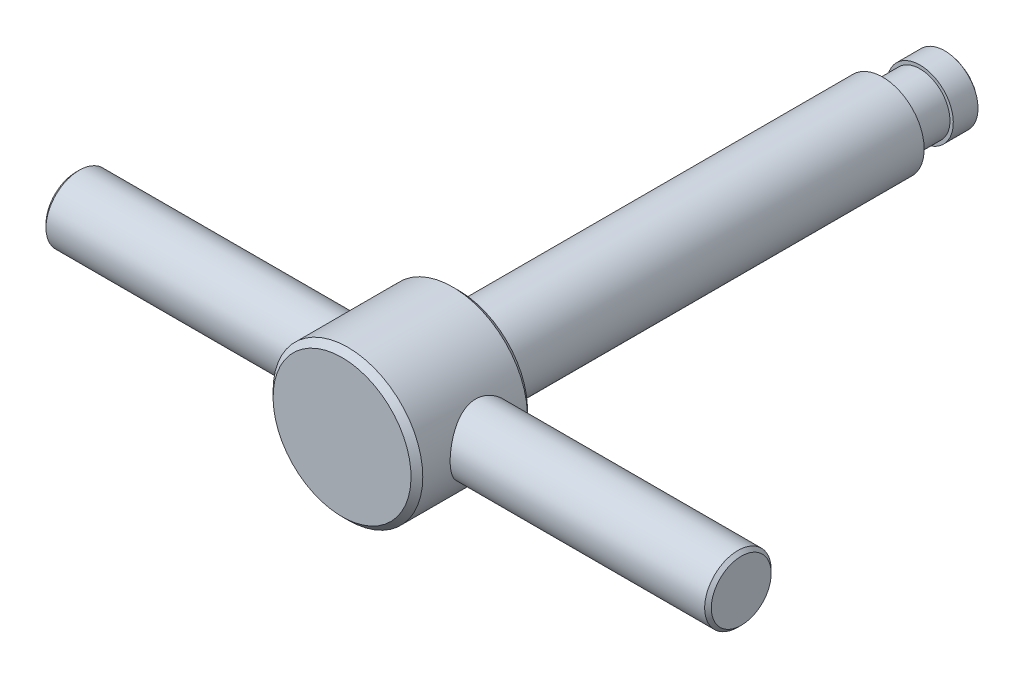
ISO-10303-21;
HEADER;
FILE_DESCRIPTION(('STEP AP214'),'2;1');
FILE_NAME('part.step','',(''),(''),'','','');
FILE_SCHEMA(('AUTOMOTIVE_DESIGN { 1 0 10303 214 1 1 1 1 }'));
ENDSEC;
DATA;
#1=APPLICATION_CONTEXT('core data for automotive mechanical design processes');
#2=APPLICATION_PROTOCOL_DEFINITION('international standard','automotive_design',2000,#1);
#3=PRODUCT_CONTEXT('',#1,'mechanical');
#4=PRODUCT('Part','Part','',(#3));
#5=PRODUCT_RELATED_PRODUCT_CATEGORY('part','',(#4));
#6=PRODUCT_DEFINITION_FORMATION('','',#4);
#7=PRODUCT_DEFINITION_CONTEXT('part definition',#1,'design');
#8=PRODUCT_DEFINITION('design','',#6,#7);
#9=PRODUCT_DEFINITION_SHAPE('','',#8);
#10=(LENGTH_UNIT() NAMED_UNIT(*) SI_UNIT(.MILLI.,.METRE.));
#11=(NAMED_UNIT(*) PLANE_ANGLE_UNIT() SI_UNIT($,.RADIAN.));
#12=(NAMED_UNIT(*) SI_UNIT($,.STERADIAN.) SOLID_ANGLE_UNIT());
#13=UNCERTAINTY_MEASURE_WITH_UNIT(LENGTH_MEASURE(1.E-05),#10,'distance_accuracy_value','');
#14=(GEOMETRIC_REPRESENTATION_CONTEXT(3) GLOBAL_UNCERTAINTY_ASSIGNED_CONTEXT((#13)) GLOBAL_UNIT_ASSIGNED_CONTEXT((#10,
#11,#12)) REPRESENTATION_CONTEXT('',''));
#15=CARTESIAN_POINT('',(0.,0.,0.));
#16=DIRECTION('',(0.,0.,1.));
#17=DIRECTION('',(1.,0.,0.));
#18=AXIS2_PLACEMENT_3D('',#15,#16,#17);
#19=CARTESIAN_POINT('',(40.,0.,69.6));
#20=DIRECTION('',(-1.,0.,0.));
#21=DIRECTION('',(0.,-1.,0.));
#22=AXIS2_PLACEMENT_3D('',#19,#20,#21);
#23=PLANE('',#22);
#24=CARTESIAN_POINT('',(40.0000000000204,0.,66.));
#25=DIRECTION('',(-1.,0.,0.));
#26=DIRECTION('',(0.,-1.,0.));
#27=AXIS2_PLACEMENT_3D('',#24,#25,#26);
#28=CIRCLE('',#27,3.59999999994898);
#29=CARTESIAN_POINT('',(40.0000000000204,-3.59999999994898,66.));
#30=VERTEX_POINT('',#29);
#31=EDGE_CURVE('E15',#30,#30,#28,.T.);
#32=ORIENTED_EDGE('',*,*,#31,.F.);
#33=EDGE_LOOP('',(#32));
#34=FACE_BOUND('',#33,.T.);
#35=ADVANCED_FACE('F12',(#34),#23,.F.);
#36=CARTESIAN_POINT('',(-40.,0.,66.));
#37=DIRECTION('',(1.,0.,0.));
#38=DIRECTION('',(0.,1.,0.));
#39=AXIS2_PLACEMENT_3D('',#36,#37,#38);
#40=PLANE('',#39);
#41=CARTESIAN_POINT('',(-40.0000000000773,0.,66.));
#42=DIRECTION('',(1.,0.,0.));
#43=DIRECTION('',(0.,1.,0.));
#44=AXIS2_PLACEMENT_3D('',#41,#42,#43);
#45=CIRCLE('',#44,3.60000000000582);
#46=CARTESIAN_POINT('',(-40.0000000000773,3.60000000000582,66.));
#47=VERTEX_POINT('',#46);
#48=EDGE_CURVE('E133',#47,#47,#45,.T.);
#49=ORIENTED_EDGE('',*,*,#48,.F.);
#50=EDGE_LOOP('',(#49));
#51=FACE_BOUND('',#50,.T.);
#52=ADVANCED_FACE('F171',(#51),#40,.F.);
#53=CARTESIAN_POINT('',(0.,0.,6.));
#54=DIRECTION('',(-1.,0.,0.));
#55=DIRECTION('',(0.,1.,0.));
#56=AXIS2_PLACEMENT_3D('',#53,#54,#55);
#57=SPHERICAL_SURFACE('',#56,6.);
#58=CARTESIAN_POINT('',(0.,0.,1.52786404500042));
#59=DIRECTION('',(0.,0.,1.));
#60=DIRECTION('',(0.,-1.,0.));
#61=AXIS2_PLACEMENT_3D('',#58,#59,#60);
#62=CIRCLE('',#61,4.);
#63=CARTESIAN_POINT('',(0.,-4.,1.52786404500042));
#64=VERTEX_POINT('',#63);
#65=EDGE_CURVE('E126',#64,#64,#62,.T.);
#66=ORIENTED_EDGE('',*,*,#65,.F.);
#67=EDGE_LOOP('',(#66));
#68=FACE_BOUND('',#67,.T.);
#69=ADVANCED_FACE('F168',(#68),#57,.T.);
#70=CARTESIAN_POINT('',(39.6000000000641,0.,66.));
#71=DIRECTION('',(-1.,0.,0.));
#72=DIRECTION('',(0.,-1.,0.));
#73=AXIS2_PLACEMENT_3D('',#70,#71,#72);
#74=CONICAL_SURFACE('',#73,3.99999999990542,0.785398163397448);
#75=CARTESIAN_POINT('',(39.6,0.,66.));
#76=DIRECTION('',(-1.,0.,0.));
#77=DIRECTION('',(0.,-1.,0.));
#78=AXIS2_PLACEMENT_3D('',#75,#76,#77);
#79=CIRCLE('',#78,4.);
#80=CARTESIAN_POINT('',(39.6,-4.,66.));
#81=VERTEX_POINT('',#80);
#82=EDGE_CURVE('E124',#81,#81,#79,.T.);
#83=ORIENTED_EDGE('',*,*,#82,.F.);
#84=EDGE_LOOP('',(#83));
#85=FACE_BOUND('',#84,.T.);
#86=ORIENTED_EDGE('',*,*,#31,.T.);
#87=EDGE_LOOP('',(#86));
#88=FACE_BOUND('',#87,.T.);
#89=ADVANCED_FACE('F164',(#85,#88),#74,.T.);
#90=CARTESIAN_POINT('',(0.,0.,74.));
#91=DIRECTION('',(0.,0.,-1.));
#92=DIRECTION('',(0.,1.,0.));
#93=AXIS2_PLACEMENT_3D('',#90,#91,#92);
#94=PLANE('',#93);
#95=CARTESIAN_POINT('',(0.,0.,74.));
#96=DIRECTION('',(0.,0.,-1.));
#97=DIRECTION('',(0.,1.,0.));
#98=AXIS2_PLACEMENT_3D('',#95,#96,#97);
#99=CIRCLE('',#98,8.29289321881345);
#100=CARTESIAN_POINT('',(0.,8.29289321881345,74.));
#101=VERTEX_POINT('',#100);
#102=EDGE_CURVE('E121',#101,#101,#99,.T.);
#103=ORIENTED_EDGE('',*,*,#102,.F.);
#104=EDGE_LOOP('',(#103));
#105=FACE_BOUND('',#104,.T.);
#106=ADVANCED_FACE('F160',(#105),#94,.F.);
#107=CARTESIAN_POINT('',(-39.6000000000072,0.,66.));
#108=DIRECTION('',(1.,0.,0.));
#109=DIRECTION('',(0.,1.,0.));
#110=AXIS2_PLACEMENT_3D('',#107,#108,#109);
#111=CONICAL_SURFACE('',#110,4.00000000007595,0.785398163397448);
#112=ORIENTED_EDGE('',*,*,#48,.T.);
#113=EDGE_LOOP('',(#112));
#114=FACE_BOUND('',#113,.T.);
#115=CARTESIAN_POINT('',(-39.6,0.,66.));
#116=DIRECTION('',(-1.,0.,0.));
#117=DIRECTION('',(0.,-1.,0.));
#118=AXIS2_PLACEMENT_3D('',#115,#116,#117);
#119=CIRCLE('',#118,4.);
#120=CARTESIAN_POINT('',(-39.6,-4.,66.));
#121=VERTEX_POINT('',#120);
#122=EDGE_CURVE('E117',#121,#121,#119,.F.);
#123=ORIENTED_EDGE('',*,*,#122,.F.);
#124=EDGE_LOOP('',(#123));
#125=FACE_BOUND('',#124,.T.);
#126=ADVANCED_FACE('F154',(#114,#125),#111,.T.);
#127=CARTESIAN_POINT('',(0.,0.,0.));
#128=DIRECTION('',(0.,0.,1.));
#129=DIRECTION('',(0.,-1.,0.));
#130=AXIS2_PLACEMENT_3D('',#127,#128,#129);
#131=CYLINDRICAL_SURFACE('',#130,4.);
#132=CARTESIAN_POINT('',(0.,0.,4.5));
#133=DIRECTION('',(0.,0.,1.));
#134=DIRECTION('',(0.,-1.,0.));
#135=AXIS2_PLACEMENT_3D('',#132,#133,#134);
#136=CIRCLE('',#135,4.);
#137=CARTESIAN_POINT('',(0.,-4.,4.5));
#138=VERTEX_POINT('',#137);
#139=EDGE_CURVE('E120',#138,#138,#136,.F.);
#140=ORIENTED_EDGE('',*,*,#139,.T.);
#141=EDGE_LOOP('',(#140));
#142=FACE_BOUND('',#141,.T.);
#143=ORIENTED_EDGE('',*,*,#65,.T.);
#144=EDGE_LOOP('',(#143));
#145=FACE_BOUND('',#144,.T.);
#146=ADVANCED_FACE('F147',(#142,#145),#131,.T.);
#147=CARTESIAN_POINT('',(40.,0.,66.));
#148=DIRECTION('',(-1.,0.,0.));
#149=DIRECTION('',(0.,-1.,0.));
#150=AXIS2_PLACEMENT_3D('',#147,#148,#149);
#151=CYLINDRICAL_SURFACE('',#150,4.);
#152=CARTESIAN_POINT('',(8.06476391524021,3.99494467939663,65.798960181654));
#153=CARTESIAN_POINT('',(8.0674363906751,3.98955069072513,65.6917916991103));
#154=CARTESIAN_POINT('',(8.07224351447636,3.97984050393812,65.5848598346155));
#155=CARTESIAN_POINT('',(8.08595698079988,3.95190310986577,65.3723346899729));
#156=CARTESIAN_POINT('',(8.09486596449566,3.93367041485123,65.2667423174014));
#157=CARTESIAN_POINT('',(8.1164936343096,3.88884963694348,65.0574951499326));
#158=CARTESIAN_POINT('',(8.12922056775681,3.86224345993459,64.9538450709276));
#159=CARTESIAN_POINT('',(8.15804439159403,3.80098041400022,64.7494181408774));
#160=CARTESIAN_POINT('',(8.17414274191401,3.76632005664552,64.6486425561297));
#161=CARTESIAN_POINT('',(8.22656181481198,3.65113741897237,64.3526432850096));
#162=CARTESIAN_POINT('',(8.26714545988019,3.5591418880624,64.1624986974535));
#163=CARTESIAN_POINT('',(8.35509007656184,3.34746985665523,63.8003347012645));
#164=CARTESIAN_POINT('',(8.40244957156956,3.22779938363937,63.6283113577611));
#165=CARTESIAN_POINT('',(8.50255442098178,2.95450812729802,63.2943598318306));
#166=CARTESIAN_POINT('',(8.55544737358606,2.79913804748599,63.1339022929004));
#167=CARTESIAN_POINT('',(8.65812797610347,2.46325909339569,62.84055405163));
#168=CARTESIAN_POINT('',(8.70791461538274,2.28274209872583,62.7076722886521));
#169=CARTESIAN_POINT('',(8.80064485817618,1.8946227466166,62.4695960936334));
#170=CARTESIAN_POINT('',(8.84333491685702,1.68636462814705,62.3653643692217));
#171=CARTESIAN_POINT('',(8.9150668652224,1.2528812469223,62.1941495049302));
#172=CARTESIAN_POINT('',(8.94411720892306,1.0276665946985,62.1271432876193));
#173=CARTESIAN_POINT('',(8.98362691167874,0.583621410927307,62.0367850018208));
#174=CARTESIAN_POINT('',(8.99524674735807,0.365450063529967,62.010702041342));
#175=CARTESIAN_POINT('',(9.00236834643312,-0.0724466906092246,61.994665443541));
#176=CARTESIAN_POINT('',(8.99787565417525,-0.29217153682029,62.0046993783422));
#177=CARTESIAN_POINT('',(8.97401242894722,-0.713505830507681,62.058754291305));
#178=CARTESIAN_POINT('',(8.95551820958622,-0.91542763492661,62.1007741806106));
#179=CARTESIAN_POINT('',(8.906496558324,-1.3090787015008,62.2147237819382));
#180=CARTESIAN_POINT('',(8.87596762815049,-1.50080669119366,62.2866572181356));
#181=CARTESIAN_POINT('',(8.80455207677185,-1.87547227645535,62.4607030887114));
#182=CARTESIAN_POINT('',(8.76336986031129,-2.05794367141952,62.5636936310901));
#183=CARTESIAN_POINT('',(8.67491934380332,-2.40367819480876,62.7959802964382));
#184=CARTESIAN_POINT('',(8.62764839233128,-2.56693289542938,62.9252878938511));
#185=CARTESIAN_POINT('',(8.52733500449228,-2.88345343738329,63.2186407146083));
#186=CARTESIAN_POINT('',(8.47413447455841,-3.03485363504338,63.3846457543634));
#187=CARTESIAN_POINT('',(8.37116616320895,-3.308319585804,63.74050517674));
#188=CARTESIAN_POINT('',(8.32139959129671,-3.43037504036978,63.9303678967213));
#189=CARTESIAN_POINT('',(8.25323791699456,-3.58991873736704,64.2319859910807));
#190=CARTESIAN_POINT('',(8.23138148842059,-3.6396163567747,64.3366658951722));
#191=CARTESIAN_POINT('',(8.19085970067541,-3.72991512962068,64.5504567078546));
#192=CARTESIAN_POINT('',(8.17219290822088,-3.77052037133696,64.6595655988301));
#193=CARTESIAN_POINT('',(8.13875174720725,-3.84217195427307,64.8813867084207));
#194=CARTESIAN_POINT('',(8.12397512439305,-3.87322383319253,64.9940967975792));
#195=CARTESIAN_POINT('',(8.09888899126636,-3.92540937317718,65.2222776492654));
#196=CARTESIAN_POINT('',(8.08857897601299,-3.94654415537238,65.3377480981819));
#197=CARTESIAN_POINT('',(8.07352903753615,-3.97723443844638,65.560511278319));
#198=CARTESIAN_POINT('',(8.06838950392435,-3.98762282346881,65.6676629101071));
#199=CARTESIAN_POINT('',(8.06239632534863,-3.99972645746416,65.8826133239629));
#200=CARTESIAN_POINT('',(8.06154410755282,-4.00143881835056,65.9904123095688));
#201=CARTESIAN_POINT('',(8.06416377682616,-3.99615739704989,66.2056866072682));
#202=CARTESIAN_POINT('',(8.06763316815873,-3.98916863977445,66.3131620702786));
#203=CARTESIAN_POINT('',(8.0787556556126,-3.96659203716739,66.5269998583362));
#204=CARTESIAN_POINT('',(8.08641032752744,-3.95100095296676,66.633361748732));
#205=CARTESIAN_POINT('',(8.11411734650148,-3.89395643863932,66.936808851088));
#206=CARTESIAN_POINT('',(8.13915387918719,-3.84181494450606,67.1315464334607));
#207=CARTESIAN_POINT('',(8.20019833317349,-3.70971266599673,67.5093683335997));
#208=CARTESIAN_POINT('',(8.23620931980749,-3.62974410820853,67.6924493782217));
#209=CARTESIAN_POINT('',(8.31800045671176,-3.43836581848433,68.0548139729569));
#210=CARTESIAN_POINT('',(8.36426005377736,-3.32526432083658,68.2330954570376));
#211=CARTESIAN_POINT('',(8.4601853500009,-3.07301957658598,68.569191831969));
#212=CARTESIAN_POINT('',(8.50985275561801,-2.93386322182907,68.7269963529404));
#213=CARTESIAN_POINT('',(8.61220177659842,-2.61910352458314,69.0319010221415));
#214=CARTESIAN_POINT('',(8.66476664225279,-2.44137600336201,69.1768548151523));
#215=CARTESIAN_POINT('',(8.76272732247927,-2.06222856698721,69.4350697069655));
#216=CARTESIAN_POINT('',(8.80812349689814,-1.86080984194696,69.5483323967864));
#217=CARTESIAN_POINT('',(8.86679691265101,-1.54634908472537,69.6907848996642));
#218=CARTESIAN_POINT('',(8.88470775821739,-1.44012145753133,69.7335261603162));
#219=CARTESIAN_POINT('',(8.91705638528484,-1.22393436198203,69.8098687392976));
#220=CARTESIAN_POINT('',(8.93149573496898,-1.11397660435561,69.8434741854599));
#221=CARTESIAN_POINT('',(8.95646868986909,-0.891198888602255,69.9011543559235));
#222=CARTESIAN_POINT('',(8.96700361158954,-0.77837990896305,69.9252322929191));
#223=CARTESIAN_POINT('',(8.98385549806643,-0.550776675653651,69.9635789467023));
#224=CARTESIAN_POINT('',(8.99017280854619,-0.43599258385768,69.9778484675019));
#225=CARTESIAN_POINT('',(8.99806065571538,-0.214809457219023,69.9956416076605));
#226=CARTESIAN_POINT('',(8.99997424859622,-0.108484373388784,69.9999420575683));
#227=CARTESIAN_POINT('',(9.00002524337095,0.104207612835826,70.0000567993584));
#228=CARTESIAN_POINT('',(8.9981613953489,0.21057451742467,69.9958682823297));
#229=CARTESIAN_POINT('',(8.99070376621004,0.422458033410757,69.9790467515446));
#230=CARTESIAN_POINT('',(8.98511182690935,0.527975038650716,69.9664179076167));
#231=CARTESIAN_POINT('',(8.97035313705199,0.737441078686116,69.9328682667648));
#232=CARTESIAN_POINT('',(8.96118504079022,0.841389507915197,69.9119443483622));
#233=CARTESIAN_POINT('',(8.92926991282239,1.14378810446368,69.8384680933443));
#234=CARTESIAN_POINT('',(8.90186225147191,1.33914830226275,69.7746789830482));
#235=CARTESIAN_POINT('',(8.83691701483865,1.71629114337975,69.6188512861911));
#236=CARTESIAN_POINT('',(8.79937717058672,1.89807073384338,69.5268063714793));
#237=CARTESIAN_POINT('',(8.71504520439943,2.25465298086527,69.310958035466));
#238=CARTESIAN_POINT('',(8.66784014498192,2.42842451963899,69.1856110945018));
#239=CARTESIAN_POINT('',(8.57018496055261,2.75332137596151,68.9094286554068));
#240=CARTESIAN_POINT('',(8.51973331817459,2.9044359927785,68.7585811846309));
#241=CARTESIAN_POINT('',(8.41670323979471,3.19123729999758,68.4224415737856));
#242=CARTESIAN_POINT('',(8.36423990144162,3.32498176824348,68.2354353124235));
#243=CARTESIAN_POINT('',(8.29155306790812,3.50059748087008,67.9388357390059));
#244=CARTESIAN_POINT('',(8.26830941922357,3.55500246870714,67.8372003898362));
#245=CARTESIAN_POINT('',(8.22458395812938,3.65502305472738,67.6291423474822));
#246=CARTESIAN_POINT('',(8.20410079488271,3.70064295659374,67.5227220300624));
#247=CARTESIAN_POINT('',(8.1669486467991,3.78191948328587,67.3076954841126));
#248=CARTESIAN_POINT('',(8.15021891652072,3.81773722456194,67.1991606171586));
#249=CARTESIAN_POINT('',(8.12074390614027,3.88003965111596,66.9789649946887));
#250=CARTESIAN_POINT('',(8.10799658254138,3.90652912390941,66.86730587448));
#251=CARTESIAN_POINT('',(8.08700366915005,3.94980378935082,66.6420096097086));
#252=CARTESIAN_POINT('',(8.0787465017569,3.96661394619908,66.5283783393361));
#253=CARTESIAN_POINT('',(8.06702851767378,3.99039233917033,66.299903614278));
#254=CARTESIAN_POINT('',(8.06356411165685,3.99736794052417,66.1850611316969));
#255=CARTESIAN_POINT('',(8.06216903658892,4.00017832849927,66.0249404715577));
#256=CARTESIAN_POINT('',(8.06215649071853,4.00020413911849,65.9797165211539));
#257=CARTESIAN_POINT('',(8.06289099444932,3.99872351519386,65.8893011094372));
#258=CARTESIAN_POINT('',(8.06363801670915,3.99721713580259,65.8441096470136));
#259=CARTESIAN_POINT('',(8.06476391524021,3.99494467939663,65.798960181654));
#260=B_SPLINE_CURVE_WITH_KNOTS('',3,(#152,#153,#154,#155,#156,#157,#158,#159,#160,#161,#162,
#163,#164,#165,#166,#167,#168,#169,#170,#171,#172,#173,#174,#175,#176,#177,#178,#179,#180,#181,
#182,#183,#184,#185,#186,#187,#188,#189,#190,#191,#192,#193,#194,#195,#196,#197,#198,#199,#200,
#201,#202,#203,#204,#205,#206,#207,#208,#209,#210,#211,#212,#213,#214,#215,#216,#217,#218,#219,
#220,#221,#222,#223,#224,#225,#226,#227,#228,#229,#230,#231,#232,#233,#234,#235,#236,#237,#238,
#239,#240,#241,#242,#243,#244,#245,#246,#247,#248,#249,#250,#251,#252,#253,#254,#255,#256,#257,
#258,#259),.UNSPECIFIED.,.T.,.F.,(4,2,2,2,2,2,2,2,2,2,2,2,2,2,2,2,2,2,2,2,2,2,2,2,2,2,2,2,2,2,2,
2,2,2,2,2,2,2,2,2,2,2,2,2,2,2,2,2,2,2,2,2,2,4),(0.,0.32196412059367,0.644135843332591,
0.967008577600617,1.29002141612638,1.93223985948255,2.5743185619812,3.25984229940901,
3.94558792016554,4.6521458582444,5.35826528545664,6.01488562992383,6.67128005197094,
7.2896766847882,7.90815032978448,8.54607805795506,9.18428452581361,9.87393008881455,
10.56381733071,10.9171864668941,11.2703963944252,11.6234011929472,11.9763660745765,
12.2992695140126,12.6222804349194,12.9451049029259,13.2680510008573,13.8745774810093,
14.4812735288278,15.1270009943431,15.7730542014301,16.4756628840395,17.1782362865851,
17.5255354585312,17.8726774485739,18.2197022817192,18.566698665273,18.8855869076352,
19.2045806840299,19.5234169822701,19.8423733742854,20.4613785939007,21.0805225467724,
21.7359055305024,22.3915970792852,23.095340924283,23.4477730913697,23.8000321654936,
24.1460959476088,24.4919818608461,24.8369716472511,25.1817029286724,25.3173494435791,
25.4529910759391),.UNSPECIFIED.);
#261=CARTESIAN_POINT('',(8.06476391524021,3.99494467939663,65.798960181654));
#262=VERTEX_POINT('',#261);
#263=EDGE_CURVE('E46',#262,#262,#260,.T.);
#264=ORIENTED_EDGE('',*,*,#263,.F.);
#265=EDGE_LOOP('',(#264));
#266=FACE_BOUND('',#265,.T.);
#267=ORIENTED_EDGE('',*,*,#82,.T.);
#268=EDGE_LOOP('',(#267));
#269=FACE_BOUND('',#268,.T.);
#270=ADVANCED_FACE('F145',(#266,#269),#151,.T.);
#271=CARTESIAN_POINT('',(0.,0.,73.2928932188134));
#272=DIRECTION('',(0.,0.,-1.));
#273=DIRECTION('',(0.,1.,0.));
#274=AXIS2_PLACEMENT_3D('',#271,#272,#273);
#275=CONICAL_SURFACE('',#274,9.,0.785398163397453);
#276=ORIENTED_EDGE('',*,*,#102,.T.);
#277=EDGE_LOOP('',(#276));
#278=FACE_BOUND('',#277,.T.);
#279=CARTESIAN_POINT('',(0.,0.,73.2928932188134));
#280=DIRECTION('',(0.,0.,1.));
#281=DIRECTION('',(0.,-1.,0.));
#282=AXIS2_PLACEMENT_3D('',#279,#280,#281);
#283=CIRCLE('',#282,9.);
#284=CARTESIAN_POINT('',(0.,-9.,73.2928932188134));
#285=VERTEX_POINT('',#284);
#286=EDGE_CURVE('E45',#285,#285,#283,.F.);
#287=ORIENTED_EDGE('',*,*,#286,.F.);
#288=EDGE_LOOP('',(#287));
#289=FACE_BOUND('',#288,.T.);
#290=ADVANCED_FACE('F72',(#278,#289),#275,.T.);
#291=CARTESIAN_POINT('',(40.,0.,66.));
#292=DIRECTION('',(-1.,0.,0.));
#293=DIRECTION('',(0.,-1.,0.));
#294=AXIS2_PLACEMENT_3D('',#291,#292,#293);
#295=CYLINDRICAL_SURFACE('',#294,4.);
#296=ORIENTED_EDGE('',*,*,#122,.T.);
#297=EDGE_LOOP('',(#296));
#298=FACE_BOUND('',#297,.T.);
#299=CARTESIAN_POINT('',(-8.06476391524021,3.99494467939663,66.201039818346));
#300=CARTESIAN_POINT('',(-8.0674363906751,3.98955069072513,66.3082083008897));
#301=CARTESIAN_POINT('',(-8.07224351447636,3.97984050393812,66.4151401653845));
#302=CARTESIAN_POINT('',(-8.08595698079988,3.95190310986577,66.6276653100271));
#303=CARTESIAN_POINT('',(-8.09486596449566,3.93367041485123,66.7332576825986));
#304=CARTESIAN_POINT('',(-8.1164936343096,3.88884963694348,66.9425048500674));
#305=CARTESIAN_POINT('',(-8.1292205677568,3.86224345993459,67.0461549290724));
#306=CARTESIAN_POINT('',(-8.15804439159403,3.80098041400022,67.2505818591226));
#307=CARTESIAN_POINT('',(-8.17414274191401,3.76632005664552,67.3513574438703));
#308=CARTESIAN_POINT('',(-8.22656181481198,3.65113741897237,67.6473567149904));
#309=CARTESIAN_POINT('',(-8.26714545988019,3.5591418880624,67.8375013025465));
#310=CARTESIAN_POINT('',(-8.35509007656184,3.34746985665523,68.1996652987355));
#311=CARTESIAN_POINT('',(-8.40244957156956,3.22779938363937,68.3716886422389));
#312=CARTESIAN_POINT('',(-8.50255442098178,2.95450812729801,68.7056401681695));
#313=CARTESIAN_POINT('',(-8.55544737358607,2.79913804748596,68.8660977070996));
#314=CARTESIAN_POINT('',(-8.65812797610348,2.46325909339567,69.1594459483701));
#315=CARTESIAN_POINT('',(-8.70791461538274,2.28274209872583,69.292327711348));
#316=CARTESIAN_POINT('',(-8.80064485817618,1.8946227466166,69.5304039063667));
#317=CARTESIAN_POINT('',(-8.84333491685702,1.68636462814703,69.6346356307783));
#318=CARTESIAN_POINT('',(-8.91506686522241,1.25288124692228,69.8058504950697));
#319=CARTESIAN_POINT('',(-8.94411720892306,1.0276665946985,69.8728567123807));
#320=CARTESIAN_POINT('',(-8.98362691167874,0.583621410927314,69.9632149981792));
#321=CARTESIAN_POINT('',(-8.99524674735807,0.365450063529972,69.989297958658));
#322=CARTESIAN_POINT('',(-9.00236834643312,-0.0724466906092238,70.005334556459));
#323=CARTESIAN_POINT('',(-8.99787565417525,-0.292171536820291,69.9953006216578));
#324=CARTESIAN_POINT('',(-8.97401242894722,-0.713505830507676,69.941245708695));
#325=CARTESIAN_POINT('',(-8.95551820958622,-0.915427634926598,69.8992258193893));
#326=CARTESIAN_POINT('',(-8.906496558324,-1.3090787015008,69.7852762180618));
#327=CARTESIAN_POINT('',(-8.87596762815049,-1.50080669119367,69.7133427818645));
#328=CARTESIAN_POINT('',(-8.80455207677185,-1.87547227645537,69.5392969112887));
#329=CARTESIAN_POINT('',(-8.7633698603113,-2.05794367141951,69.4363063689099));
#330=CARTESIAN_POINT('',(-8.67491934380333,-2.40367819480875,69.2040197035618));
#331=CARTESIAN_POINT('',(-8.62764839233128,-2.56693289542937,69.0747121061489));
#332=CARTESIAN_POINT('',(-8.52733500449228,-2.88345343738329,68.7813592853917));
#333=CARTESIAN_POINT('',(-8.47413447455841,-3.03485363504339,68.6153542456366));
#334=CARTESIAN_POINT('',(-8.37116616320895,-3.308319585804,68.25949482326));
#335=CARTESIAN_POINT('',(-8.32139959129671,-3.43037504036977,68.0696321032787));
#336=CARTESIAN_POINT('',(-8.25323791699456,-3.58991873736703,67.7680140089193));
#337=CARTESIAN_POINT('',(-8.23138148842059,-3.63961635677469,67.6633341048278));
#338=CARTESIAN_POINT('',(-8.19085970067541,-3.72991512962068,67.4495432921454));
#339=CARTESIAN_POINT('',(-8.17219290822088,-3.77052037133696,67.3404344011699));
#340=CARTESIAN_POINT('',(-8.13875174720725,-3.84217195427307,67.1186132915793));
#341=CARTESIAN_POINT('',(-8.12397512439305,-3.87322383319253,67.0059032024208));
#342=CARTESIAN_POINT('',(-8.09888899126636,-3.92540937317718,66.7777223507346));
#343=CARTESIAN_POINT('',(-8.08857897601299,-3.94654415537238,66.6622519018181));
#344=CARTESIAN_POINT('',(-8.07352903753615,-3.97723443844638,66.439488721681));
#345=CARTESIAN_POINT('',(-8.06838950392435,-3.98762282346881,66.3323370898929));
#346=CARTESIAN_POINT('',(-8.06239632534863,-3.99972645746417,66.1173866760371));
#347=CARTESIAN_POINT('',(-8.06154410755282,-4.00143881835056,66.0095876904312));
#348=CARTESIAN_POINT('',(-8.06416377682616,-3.99615739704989,65.7943133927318));
#349=CARTESIAN_POINT('',(-8.06763316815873,-3.98916863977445,65.6868379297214));
#350=CARTESIAN_POINT('',(-8.0787556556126,-3.96659203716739,65.4730001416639));
#351=CARTESIAN_POINT('',(-8.08641032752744,-3.95100095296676,65.366638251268));
#352=CARTESIAN_POINT('',(-8.11411734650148,-3.89395643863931,65.063191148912));
#353=CARTESIAN_POINT('',(-8.13915387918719,-3.84181494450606,64.8684535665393));
#354=CARTESIAN_POINT('',(-8.20019833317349,-3.70971266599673,64.4906316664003));
#355=CARTESIAN_POINT('',(-8.23620931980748,-3.62974410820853,64.3075506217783));
#356=CARTESIAN_POINT('',(-8.31800045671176,-3.43836581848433,63.9451860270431));
#357=CARTESIAN_POINT('',(-8.36426005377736,-3.32526432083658,63.7669045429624));
#358=CARTESIAN_POINT('',(-8.4601853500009,-3.07301957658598,63.430808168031));
#359=CARTESIAN_POINT('',(-8.50985275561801,-2.93386322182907,63.2730036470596));
#360=CARTESIAN_POINT('',(-8.61220177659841,-2.61910352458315,62.9680989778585));
#361=CARTESIAN_POINT('',(-8.66476664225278,-2.44137600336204,62.8231451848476));
#362=CARTESIAN_POINT('',(-8.76272732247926,-2.06222856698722,62.5649302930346));
#363=CARTESIAN_POINT('',(-8.80812349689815,-1.86080984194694,62.4516676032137));
#364=CARTESIAN_POINT('',(-8.86679691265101,-1.54634908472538,62.3092151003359));
#365=CARTESIAN_POINT('',(-8.88470775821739,-1.44012145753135,62.2664738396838));
#366=CARTESIAN_POINT('',(-8.91705638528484,-1.22393436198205,62.1901312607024));
#367=CARTESIAN_POINT('',(-8.93149573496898,-1.11397660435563,62.1565258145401));
#368=CARTESIAN_POINT('',(-8.95646868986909,-0.891198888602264,62.0988456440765));
#369=CARTESIAN_POINT('',(-8.96700361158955,-0.778379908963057,62.0747677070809));
#370=CARTESIAN_POINT('',(-8.98385549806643,-0.550776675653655,62.0364210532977));
#371=CARTESIAN_POINT('',(-8.99017280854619,-0.435992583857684,62.0221515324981));
#372=CARTESIAN_POINT('',(-8.99806065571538,-0.214809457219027,62.0043583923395));
#373=CARTESIAN_POINT('',(-8.99997424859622,-0.108484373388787,62.0000579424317));
#374=CARTESIAN_POINT('',(-9.00002524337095,0.104207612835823,61.9999432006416));
#375=CARTESIAN_POINT('',(-8.9981613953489,0.210574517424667,62.0041317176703));
#376=CARTESIAN_POINT('',(-8.99070376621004,0.422458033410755,62.0209532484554));
#377=CARTESIAN_POINT('',(-8.98511182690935,0.527975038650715,62.0335820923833));
#378=CARTESIAN_POINT('',(-8.97035313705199,0.737441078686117,62.0671317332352));
#379=CARTESIAN_POINT('',(-8.96118504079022,0.841389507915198,62.0880556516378));
#380=CARTESIAN_POINT('',(-8.92926991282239,1.14378810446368,62.1615319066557));
#381=CARTESIAN_POINT('',(-8.90186225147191,1.33914830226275,62.2253210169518));
#382=CARTESIAN_POINT('',(-8.83691701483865,1.71629114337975,62.3811487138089));
#383=CARTESIAN_POINT('',(-8.79937717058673,1.89807073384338,62.4731936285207));
#384=CARTESIAN_POINT('',(-8.71504520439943,2.25465298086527,62.689041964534));
#385=CARTESIAN_POINT('',(-8.66784014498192,2.42842451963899,62.8143889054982));
#386=CARTESIAN_POINT('',(-8.57018496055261,2.75332137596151,63.0905713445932));
#387=CARTESIAN_POINT('',(-8.51973331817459,2.9044359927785,63.2414188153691));
#388=CARTESIAN_POINT('',(-8.41670323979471,3.19123729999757,63.5775584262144));
#389=CARTESIAN_POINT('',(-8.36423990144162,3.32498176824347,63.7645646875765));
#390=CARTESIAN_POINT('',(-8.29155306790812,3.50059748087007,64.061164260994));
#391=CARTESIAN_POINT('',(-8.26830941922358,3.55500246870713,64.1627996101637));
#392=CARTESIAN_POINT('',(-8.22458395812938,3.65502305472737,64.3708576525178));
#393=CARTESIAN_POINT('',(-8.20410079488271,3.70064295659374,64.4772779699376));
#394=CARTESIAN_POINT('',(-8.1669486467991,3.78191948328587,64.6923045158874));
#395=CARTESIAN_POINT('',(-8.15021891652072,3.81773722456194,64.8008393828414));
#396=CARTESIAN_POINT('',(-8.12074390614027,3.88003965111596,65.0210350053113));
#397=CARTESIAN_POINT('',(-8.10799658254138,3.90652912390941,65.13269412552));
#398=CARTESIAN_POINT('',(-8.08700366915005,3.94980378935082,65.3579903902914));
#399=CARTESIAN_POINT('',(-8.0787465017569,3.96661394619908,65.4716216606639));
#400=CARTESIAN_POINT('',(-8.06702851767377,3.99039233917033,65.700096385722));
#401=CARTESIAN_POINT('',(-8.06356411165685,3.99736794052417,65.8149388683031));
#402=CARTESIAN_POINT('',(-8.06216903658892,4.00017832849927,65.9750595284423));
#403=CARTESIAN_POINT('',(-8.06215649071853,4.00020413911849,66.0202834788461));
#404=CARTESIAN_POINT('',(-8.06289099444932,3.99872351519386,66.1106988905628));
#405=CARTESIAN_POINT('',(-8.06363801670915,3.99721713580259,66.1558903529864));
#406=CARTESIAN_POINT('',(-8.06476391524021,3.99494467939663,66.201039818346));
#407=B_SPLINE_CURVE_WITH_KNOTS('',3,(#299,#300,#301,#302,#303,#304,#305,#306,#307,#308,#309,
#310,#311,#312,#313,#314,#315,#316,#317,#318,#319,#320,#321,#322,#323,#324,#325,#326,#327,#328,
#329,#330,#331,#332,#333,#334,#335,#336,#337,#338,#339,#340,#341,#342,#343,#344,#345,#346,#347,
#348,#349,#350,#351,#352,#353,#354,#355,#356,#357,#358,#359,#360,#361,#362,#363,#364,#365,#366,
#367,#368,#369,#370,#371,#372,#373,#374,#375,#376,#377,#378,#379,#380,#381,#382,#383,#384,#385,
#386,#387,#388,#389,#390,#391,#392,#393,#394,#395,#396,#397,#398,#399,#400,#401,#402,#403,#404,
#405,#406),.UNSPECIFIED.,.T.,.F.,(4,2,2,2,2,2,2,2,2,2,2,2,2,2,2,2,2,2,2,2,2,2,2,2,2,2,2,2,2,2,2,
2,2,2,2,2,2,2,2,2,2,2,2,2,2,2,2,2,2,2,2,2,2,4),(0.,0.32196412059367,0.644135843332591,
0.967008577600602,1.29002141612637,1.93223985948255,2.5743185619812,3.25984229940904,
3.9455879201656,4.65214585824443,5.35826528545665,6.01488562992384,6.67128005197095,
7.2896766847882,7.90815032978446,8.54607805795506,9.18428452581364,9.87393008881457,
10.5638173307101,10.9171864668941,11.2703963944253,11.6234011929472,11.9763660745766,
12.2992695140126,12.6222804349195,12.945104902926,13.2680510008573,13.8745774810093,
14.4812735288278,15.1270009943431,15.7730542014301,16.4756628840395,17.1782362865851,
17.5255354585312,17.8726774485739,18.2197022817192,18.566698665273,18.8855869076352,
19.2045806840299,19.5234169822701,19.8423733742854,20.4613785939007,21.0805225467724,
21.7359055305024,22.3915970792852,23.095340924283,23.4477730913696,23.8000321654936,
24.1460959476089,24.4919818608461,24.8369716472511,25.1817029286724,25.3173494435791,
25.4529910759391),.UNSPECIFIED.);
#408=CARTESIAN_POINT('',(-8.06476391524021,3.99494467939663,66.201039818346));
#409=VERTEX_POINT('',#408);
#410=EDGE_CURVE('E37',#409,#409,#407,.T.);
#411=ORIENTED_EDGE('',*,*,#410,.F.);
#412=EDGE_LOOP('',(#411));
#413=FACE_BOUND('',#412,.T.);
#414=ADVANCED_FACE('F52',(#298,#413),#295,.T.);
#415=CARTESIAN_POINT('',(3.6,0.,4.5));
#416=DIRECTION('',(0.,0.,-1.));
#417=DIRECTION('',(0.,1.,0.));
#418=AXIS2_PLACEMENT_3D('',#415,#416,#417);
#419=PLANE('',#418);
#420=CARTESIAN_POINT('',(0.,0.,4.5));
#421=DIRECTION('',(0.,0.,1.));
#422=DIRECTION('',(0.,-1.,0.));
#423=AXIS2_PLACEMENT_3D('',#420,#421,#422);
#424=CIRCLE('',#423,3.6);
#425=CARTESIAN_POINT('',(0.,-3.6,4.5));
#426=VERTEX_POINT('',#425);
#427=EDGE_CURVE('E33',#426,#426,#424,.T.);
#428=ORIENTED_EDGE('',*,*,#427,.F.);
#429=EDGE_LOOP('',(#428));
#430=FACE_BOUND('',#429,.T.);
#431=ORIENTED_EDGE('',*,*,#139,.F.);
#432=EDGE_LOOP('',(#431));
#433=FACE_BOUND('',#432,.T.);
#434=ADVANCED_FACE('F61',(#430,#433),#419,.F.);
#435=CARTESIAN_POINT('',(0.,0.,0.));
#436=DIRECTION('',(0.,0.,1.));
#437=DIRECTION('',(0.,-1.,0.));
#438=AXIS2_PLACEMENT_3D('',#435,#436,#437);
#439=CYLINDRICAL_SURFACE('',#438,9.);
#440=ORIENTED_EDGE('',*,*,#410,.T.);
#441=EDGE_LOOP('',(#440));
#442=FACE_BOUND('',#441,.T.);
#443=ORIENTED_EDGE('',*,*,#286,.T.);
#444=EDGE_LOOP('',(#443));
#445=FACE_BOUND('',#444,.T.);
#446=ORIENTED_EDGE('',*,*,#263,.T.);
#447=EDGE_LOOP('',(#446));
#448=FACE_BOUND('',#447,.T.);
#449=CARTESIAN_POINT('',(0.,0.,60.7071067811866));
#450=DIRECTION('',(0.,0.,1.));
#451=DIRECTION('',(0.,-1.,0.));
#452=AXIS2_PLACEMENT_3D('',#449,#450,#451);
#453=CIRCLE('',#452,9.);
#454=CARTESIAN_POINT('',(0.,-9.,60.7071067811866));
#455=VERTEX_POINT('',#454);
#456=EDGE_CURVE('E36',#455,#455,#453,.F.);
#457=ORIENTED_EDGE('',*,*,#456,.F.);
#458=EDGE_LOOP('',(#457));
#459=FACE_BOUND('',#458,.T.);
#460=ADVANCED_FACE('F56',(#442,#445,#448,#459),#439,.T.);
#461=CARTESIAN_POINT('',(0.,0.,0.));
#462=DIRECTION('',(0.,0.,1.));
#463=DIRECTION('',(0.,-1.,0.));
#464=AXIS2_PLACEMENT_3D('',#461,#462,#463);
#465=CYLINDRICAL_SURFACE('',#464,3.6);
#466=CARTESIAN_POINT('',(0.,0.,8.19170962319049));
#467=DIRECTION('',(0.,0.,1.));
#468=DIRECTION('',(0.,-1.,0.));
#469=AXIS2_PLACEMENT_3D('',#466,#467,#468);
#470=CIRCLE('',#469,3.60000000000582);
#471=CARTESIAN_POINT('',(0.,-3.60000000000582,8.19170962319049));
#472=VERTEX_POINT('',#471);
#473=EDGE_CURVE('E32',#472,#472,#470,.T.);
#474=ORIENTED_EDGE('',*,*,#473,.F.);
#475=EDGE_LOOP('',(#474));
#476=FACE_BOUND('',#475,.T.);
#477=ORIENTED_EDGE('',*,*,#427,.T.);
#478=EDGE_LOOP('',(#477));
#479=FACE_BOUND('',#478,.T.);
#480=ADVANCED_FACE('F60',(#476,#479),#465,.T.);
#481=CARTESIAN_POINT('',(0.,0.,60.7071067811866));
#482=DIRECTION('',(0.,0.,1.));
#483=DIRECTION('',(-1.,0.,0.));
#484=AXIS2_PLACEMENT_3D('',#481,#482,#483);
#485=CONICAL_SURFACE('',#484,9.,0.785398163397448);
#486=ORIENTED_EDGE('',*,*,#456,.T.);
#487=EDGE_LOOP('',(#486));
#488=FACE_BOUND('',#487,.T.);
#489=CARTESIAN_POINT('',(0.,0.,60.));
#490=DIRECTION('',(0.,0.,1.));
#491=DIRECTION('',(-1.,0.,0.));
#492=AXIS2_PLACEMENT_3D('',#489,#490,#491);
#493=CIRCLE('',#492,8.29289321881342);
#494=CARTESIAN_POINT('',(-8.29289321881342,0.,60.));
#495=VERTEX_POINT('',#494);
#496=EDGE_CURVE('E24',#495,#495,#493,.T.);
#497=ORIENTED_EDGE('',*,*,#496,.T.);
#498=EDGE_LOOP('',(#497));
#499=FACE_BOUND('',#498,.T.);
#500=ADVANCED_FACE('F90',(#488,#499),#485,.T.);
#501=CARTESIAN_POINT('',(0.,0.,9.00000000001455));
#502=DIRECTION('',(0.,0.,1.));
#503=DIRECTION('',(0.,-1.,0.));
#504=AXIS2_PLACEMENT_3D('',#501,#502,#503);
#505=CONICAL_SURFACE('',#504,4.99999999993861,1.047197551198);
#506=CARTESIAN_POINT('',(0.,0.,9.));
#507=DIRECTION('',(0.,0.,1.));
#508=DIRECTION('',(0.,-1.,0.));
#509=AXIS2_PLACEMENT_3D('',#506,#507,#508);
#510=CIRCLE('',#509,5.);
#511=CARTESIAN_POINT('',(0.,-5.,9.));
#512=VERTEX_POINT('',#511);
#513=EDGE_CURVE('E19',#512,#512,#510,.T.);
#514=ORIENTED_EDGE('',*,*,#513,.F.);
#515=EDGE_LOOP('',(#514));
#516=FACE_BOUND('',#515,.T.);
#517=ORIENTED_EDGE('',*,*,#473,.T.);
#518=EDGE_LOOP('',(#517));
#519=FACE_BOUND('',#518,.T.);
#520=ADVANCED_FACE('F84',(#516,#519),#505,.T.);
#521=CARTESIAN_POINT('',(8.29289321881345,0.,60.));
#522=DIRECTION('',(0.,0.,1.));
#523=DIRECTION('',(0.,-1.,0.));
#524=AXIS2_PLACEMENT_3D('',#521,#522,#523);
#525=PLANE('',#524);
#526=ORIENTED_EDGE('',*,*,#496,.F.);
#527=EDGE_LOOP('',(#526));
#528=FACE_BOUND('',#527,.T.);
#529=CARTESIAN_POINT('',(0.,0.,60.));
#530=DIRECTION('',(0.,0.,1.));
#531=DIRECTION('',(0.,-1.,0.));
#532=AXIS2_PLACEMENT_3D('',#529,#530,#531);
#533=CIRCLE('',#532,5.);
#534=CARTESIAN_POINT('',(0.,-5.,60.));
#535=VERTEX_POINT('',#534);
#536=EDGE_CURVE('E8',#535,#535,#533,.F.);
#537=ORIENTED_EDGE('',*,*,#536,.F.);
#538=EDGE_LOOP('',(#537));
#539=FACE_BOUND('',#538,.T.);
#540=ADVANCED_FACE('F78',(#528,#539),#525,.F.);
#541=CARTESIAN_POINT('',(0.,0.,0.));
#542=DIRECTION('',(0.,0.,1.));
#543=DIRECTION('',(0.,-1.,0.));
#544=AXIS2_PLACEMENT_3D('',#541,#542,#543);
#545=CYLINDRICAL_SURFACE('',#544,5.);
#546=ORIENTED_EDGE('',*,*,#536,.T.);
#547=EDGE_LOOP('',(#546));
#548=FACE_BOUND('',#547,.T.);
#549=ORIENTED_EDGE('',*,*,#513,.T.);
#550=EDGE_LOOP('',(#549));
#551=FACE_BOUND('',#550,.T.);
#552=ADVANCED_FACE('F76',(#548,#551),#545,.T.);
#553=CLOSED_SHELL('',(#35,#52,#69,#89,#106,#126,#146,#270,#290,#414,#434,#460,#480,#500,#520,
#540,#552));
#554=MANIFOLD_SOLID_BREP('B1',#553);
#555=ADVANCED_BREP_SHAPE_REPRESENTATION('',(#18,#554),#14);
#556=SHAPE_DEFINITION_REPRESENTATION(#9,#555);
ENDSEC;
END-ISO-10303-21;
